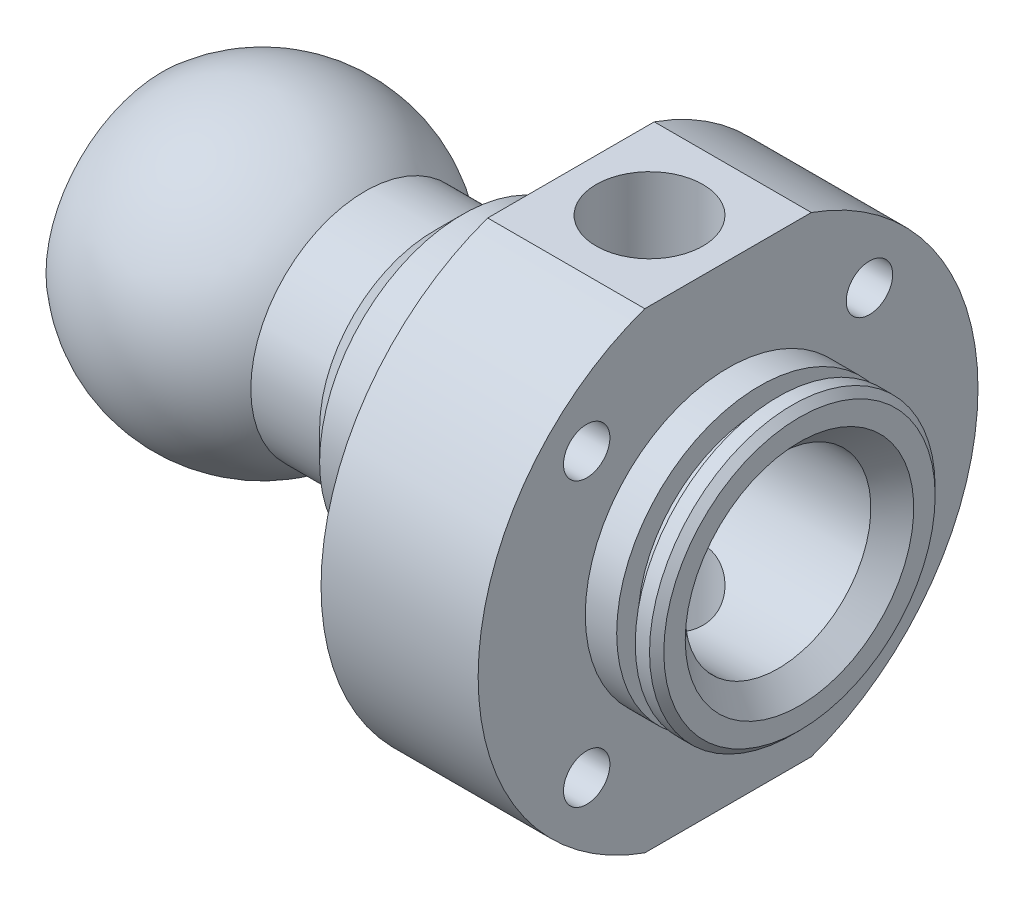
from build123d import *

# Parameters (mm, degrees)
ESQUISSE2_OUTSIDE_W          = 117.85
ESQUISSE2_OUTSIDE_H          = 98.65
ESQUISSE2_OUTSIDE_W_2        = 105
ESQUISSE2_OUTSIDE_H_2        = 66
ENL_V_MAT_EXTRU_1_DEPTH      = 50
ESQUISSE3_R                  = 7.475
ENL_V_MAT_EXTRU_2_DEPTH      = 90.95004169
ESQUISSE4_R                  = 3.25
ENL_V_MAT_EXTRU_3_DEPTH      = 93.664124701
R_P_TITION_CIRCULAIRE1_COUNT = 4
CHANFREIN1_SIZE              = 1


with BuildPart() as part:
    # Esquisse1 → Base-R_volution (revolve)
    with BuildSketch(Plane.XY, mode=Mode.PRIVATE) as base_r_volution_sk:
        with BuildLine():
            Line((39.1, 16), (39.1, 20))
            Line((39.1, 20), (36.1, 20))
            Line((36.1, 20), (36.1, 17))
            Line((36.1, 17), (33.5, 17))
            Line((33.5, 17), (33.5, 20))
            Line((33.5, 20), (29.1, 20))
            Line((29.1, 20), (29.1, 35))
            Line((29.1, 35), (7.1, 35))
            Line((7.1, 35), (7.1, 20))
            Line((7.1, 20), (-8.1, 20))
            Line((-8.1, 20), (-12.1, 16))
            Line((-12.1, 16), (-21.738593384, 16))
            ThreePointArc((-21.738593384, 16), (-35.859578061, 21.498655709), (-50.1, 16.317168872))
            Line((-50.1, 16.317168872), (-50.1, 10))
            Line((-50.1, 10), (-47.1, 10))
            Line((-47.1, 10), (-47.1, 13.25))
            Line((-47.1, 13.25), (-43.1, 13.25))
            Line((-43.1, 13.25), (-43.1, 10))
            Line((-43.1, 10), (-29, 10))
            Line((-29, 10), (-28.9, 10.1))
            Line((-28.9, 10.1), (8.2, 10.1))
            Line((8.2, 10.1), (11.1, 13))
            Line((11.1, 13), (36.1, 13))
            Line((36.1, 13), (39.1, 16))
        make_face()
    revolve(base_r_volution_sk.sketch.rotate(Axis((-69, 0, 0), (1, 0, 0)), 90), axis=Axis((-69, 0, 0), (1, 0, 0)))

    # Esquisse2 outside → Enl_v. mat.-Extru.1 (cut, symmetric)
    with BuildSketch(Plane.XY):
        with Locations((-5.5, 0)):
            Rectangle(ESQUISSE2_OUTSIDE_W, ESQUISSE2_OUTSIDE_H)
        with Locations((-7.5, 0)):
            Rectangle(ESQUISSE2_OUTSIDE_W_2, ESQUISSE2_OUTSIDE_H_2, mode=Mode.SUBTRACT)
    extrude(amount=ENL_V_MAT_EXTRU_1_DEPTH, both=True, mode=Mode.SUBTRACT)

    # Esquisse3 → Enl_v. mat.-Extru.2 (cut, through all)
    with BuildSketch(Plane(origin=(0, 33, 0), x_dir=(-1, 0, 0), z_dir=(0, 1, 0))):
        with Locations((-18.1, 0)):
            Circle(ESQUISSE3_R)
    extrude(amount=-ENL_V_MAT_EXTRU_2_DEPTH, mode=Mode.SUBTRACT)

    # Esquisse4 → Enl_v. mat.-Extru.3 (cut, through all)
    with BuildSketch(Plane(origin=(29.1, 0, 0), x_dir=(0, 0, -1), z_dir=(1, 0, 0))):
        with Locations((19.798989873, -19.798989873)):
            Circle(ESQUISSE4_R)
    enl_v_mat_extru_3 = extrude(amount=-ENL_V_MAT_EXTRU_3_DEPTH, mode=Mode.SUBTRACT)

    # R_p_tition circulaire1: Enl_v. mat.-Extru.3 ×4 about axis
    r_p_tition_circulaire1_axis = Axis((-69, 0, 0), (1, 0, 0))
    for i in range(1, R_P_TITION_CIRCULAIRE1_COUNT):
        add(enl_v_mat_extru_3.rotate(r_p_tition_circulaire1_axis, i * 360 / R_P_TITION_CIRCULAIRE1_COUNT), mode=Mode.SUBTRACT)

    # Chanfrein1
    chanfrein1_edges = [part.edges().sort_by_distance(p)[0] for p in [
        (39.1, 0, -20),
    ]]
    chamfer(chanfrein1_edges, length=CHANFREIN1_SIZE)


solid = part.part
